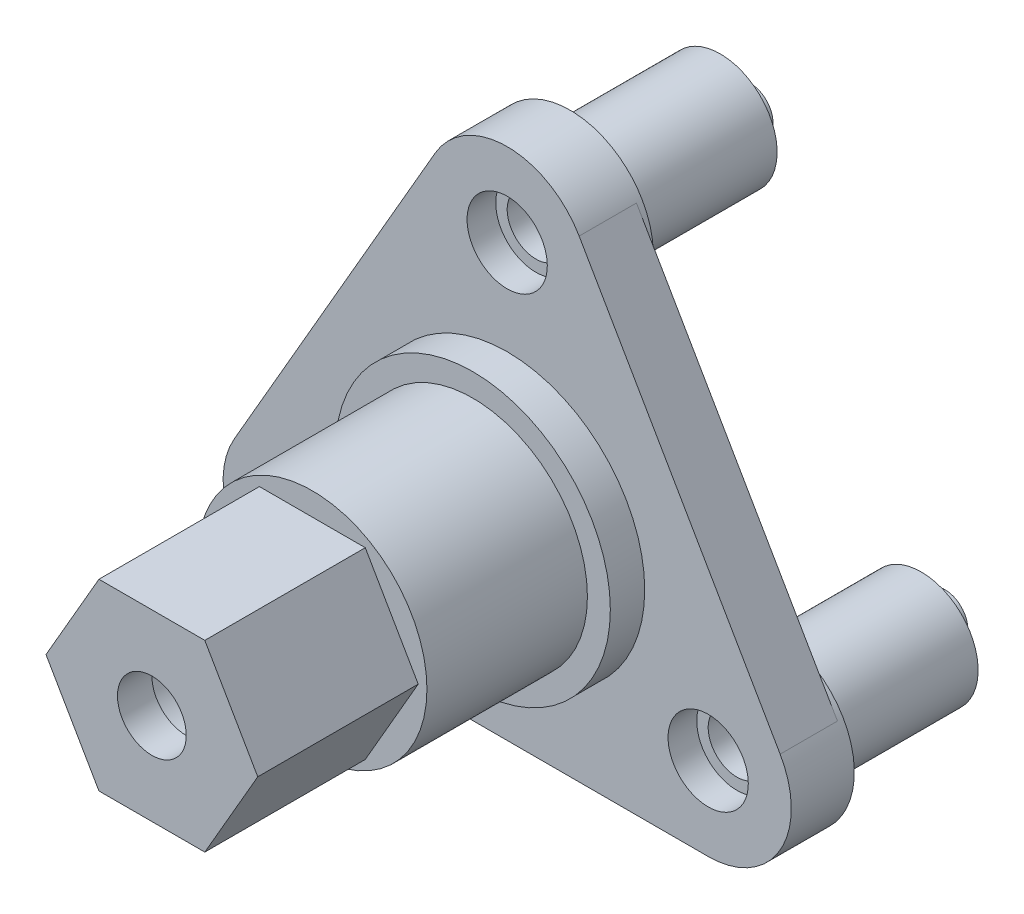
ISO-10303-21;
HEADER;
FILE_DESCRIPTION(('STEP AP214'),'2;1');
FILE_NAME('part.step','',(''),(''),'','','');
FILE_SCHEMA(('AUTOMOTIVE_DESIGN { 1 0 10303 214 1 1 1 1 }'));
ENDSEC;
DATA;
#1=APPLICATION_CONTEXT('core data for automotive mechanical design processes');
#2=APPLICATION_PROTOCOL_DEFINITION('international standard','automotive_design',2000,#1);
#3=PRODUCT_CONTEXT('',#1,'mechanical');
#4=PRODUCT('Part','Part','',(#3));
#5=PRODUCT_RELATED_PRODUCT_CATEGORY('part','',(#4));
#6=PRODUCT_DEFINITION_FORMATION('','',#4);
#7=PRODUCT_DEFINITION_CONTEXT('part definition',#1,'design');
#8=PRODUCT_DEFINITION('design','',#6,#7);
#9=PRODUCT_DEFINITION_SHAPE('','',#8);
#10=(LENGTH_UNIT() NAMED_UNIT(*) SI_UNIT(.MILLI.,.METRE.));
#11=(NAMED_UNIT(*) PLANE_ANGLE_UNIT() SI_UNIT($,.RADIAN.));
#12=(NAMED_UNIT(*) SI_UNIT($,.STERADIAN.) SOLID_ANGLE_UNIT());
#13=UNCERTAINTY_MEASURE_WITH_UNIT(LENGTH_MEASURE(1.E-05),#10,'distance_accuracy_value','');
#14=(GEOMETRIC_REPRESENTATION_CONTEXT(3) GLOBAL_UNCERTAINTY_ASSIGNED_CONTEXT((#13)) GLOBAL_UNIT_ASSIGNED_CONTEXT((#10,
#11,#12)) REPRESENTATION_CONTEXT('',''));
#15=CARTESIAN_POINT('',(0.,0.,0.));
#16=DIRECTION('',(0.,0.,1.));
#17=DIRECTION('',(1.,0.,0.));
#18=AXIS2_PLACEMENT_3D('',#15,#16,#17);
#19=CARTESIAN_POINT('',(0.,20.25,-18.6));
#20=DIRECTION('',(0.,0.,-1.));
#21=DIRECTION('',(0.499999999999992,0.866025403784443,0.));
#22=AXIS2_PLACEMENT_3D('',#19,#20,#21);
#23=PLANE('',#22);
#24=CARTESIAN_POINT('',(0.,20.25,-18.6));
#25=DIRECTION('',(0.,0.,-1.));
#26=DIRECTION('',(0.499999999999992,0.866025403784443,0.));
#27=AXIS2_PLACEMENT_3D('',#24,#25,#26);
#28=CIRCLE('',#27,4.95);
#29=CARTESIAN_POINT('',(2.47499999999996,24.536825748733,-18.6));
#30=VERTEX_POINT('',#29);
#31=EDGE_CURVE('E172',#30,#30,#28,.T.);
#32=ORIENTED_EDGE('',*,*,#31,.T.);
#33=EDGE_LOOP('',(#32));
#34=FACE_BOUND('',#33,.T.);
#35=CARTESIAN_POINT('',(0.0947521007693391,19.7934044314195,-18.6));
#36=DIRECTION('',(0.,0.,-1.));
#37=DIRECTION('',(0.499999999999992,0.866025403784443,0.));
#38=AXIS2_PLACEMENT_3D('',#35,#36,#37);
#39=CIRCLE('',#38,2.);
#40=CARTESIAN_POINT('',(1.09475210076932,21.5254552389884,-18.6));
#41=VERTEX_POINT('',#40);
#42=EDGE_CURVE('E329',#41,#41,#39,.T.);
#43=ORIENTED_EDGE('',*,*,#42,.F.);
#44=EDGE_LOOP('',(#43));
#45=FACE_BOUND('',#44,.T.);
#46=ADVANCED_FACE('F34',(#34,#45),#23,.T.);
#47=CARTESIAN_POINT('',(17.5370144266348,-10.1250000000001,-18.6));
#48=DIRECTION('',(0.,0.,-1.));
#49=DIRECTION('',(0.500000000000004,-0.866025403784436,0.));
#50=AXIS2_PLACEMENT_3D('',#47,#48,#49);
#51=PLANE('',#50);
#52=CARTESIAN_POINT('',(17.5370144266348,-10.1250000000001,-18.6));
#53=DIRECTION('',(0.,0.,-1.));
#54=DIRECTION('',(0.500000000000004,-0.866025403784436,0.));
#55=AXIS2_PLACEMENT_3D('',#52,#53,#54);
#56=CIRCLE('',#55,4.95);
#57=CARTESIAN_POINT('',(20.0120144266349,-14.411825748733,-18.6));
#58=VERTEX_POINT('',#57);
#59=EDGE_CURVE('E175',#58,#58,#56,.T.);
#60=ORIENTED_EDGE('',*,*,#59,.T.);
#61=EDGE_LOOP('',(#60));
#62=FACE_BOUND('',#61,.T.);
#63=CARTESIAN_POINT('',(17.0942150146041,-9.97875994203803,-18.6));
#64=DIRECTION('',(0.,0.,-1.));
#65=DIRECTION('',(0.500000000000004,-0.866025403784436,0.));
#66=AXIS2_PLACEMENT_3D('',#63,#64,#65);
#67=CIRCLE('',#66,2.);
#68=CARTESIAN_POINT('',(18.0942150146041,-11.7108107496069,-18.6));
#69=VERTEX_POINT('',#68);
#70=EDGE_CURVE('E162',#69,#69,#67,.T.);
#71=ORIENTED_EDGE('',*,*,#70,.F.);
#72=EDGE_LOOP('',(#71));
#73=FACE_BOUND('',#72,.T.);
#74=ADVANCED_FACE('F339',(#62,#73),#51,.T.);
#75=CARTESIAN_POINT('',(0.,20.25,-5.));
#76=DIRECTION('',(0.,0.,1.));
#77=DIRECTION('',(1.,0.,0.));
#78=AXIS2_PLACEMENT_3D('',#75,#76,#77);
#79=PLANE('',#78);
#80=CARTESIAN_POINT('',(0.,0.,-5.));
#81=DIRECTION('',(0.,0.,-1.));
#82=DIRECTION('',(-1.,0.,0.));
#83=AXIS2_PLACEMENT_3D('',#80,#81,#82);
#84=CIRCLE('',#83,10.5);
#85=CARTESIAN_POINT('',(-10.5,0.,-5.));
#86=VERTEX_POINT('',#85);
#87=EDGE_CURVE('E204',#86,#86,#84,.T.);
#88=ORIENTED_EDGE('',*,*,#87,.F.);
#89=EDGE_LOOP('',(#88));
#90=FACE_BOUND('',#89,.T.);
#91=CARTESIAN_POINT('',(0.,20.25,-5.));
#92=DIRECTION('',(0.,0.,-1.));
#93=DIRECTION('',(0.499999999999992,0.866025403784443,0.));
#94=AXIS2_PLACEMENT_3D('',#91,#92,#93);
#95=CIRCLE('',#94,7.25);
#96=CARTESIAN_POINT('',(6.27868417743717,23.875,-5.));
#97=VERTEX_POINT('',#96);
#98=CARTESIAN_POINT('',(-6.27868417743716,23.875,-5.));
#99=VERTEX_POINT('',#98);
#100=EDGE_CURVE('E134',#97,#99,#95,.T.);
#101=ORIENTED_EDGE('',*,*,#100,.F.);
#102=DIRECTION('',(0.500000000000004,-0.866025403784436,0.));
#103=VECTOR('',#102,1.);
#104=CARTESIAN_POINT('',(6.27868417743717,23.875,-5.));
#105=LINE('',#104,#103);
#106=CARTESIAN_POINT('',(23.8156986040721,-6.49999999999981,-5.));
#107=VERTEX_POINT('',#106);
#108=EDGE_CURVE('E142',#97,#107,#105,.T.);
#109=ORIENTED_EDGE('',*,*,#108,.T.);
#110=CARTESIAN_POINT('',(17.5370144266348,-10.1250000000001,-5.));
#111=DIRECTION('',(0.,0.,-1.));
#112=DIRECTION('',(0.500000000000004,-0.866025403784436,0.));
#113=AXIS2_PLACEMENT_3D('',#110,#111,#112);
#114=CIRCLE('',#113,7.25);
#115=CARTESIAN_POINT('',(17.5370144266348,-17.3749999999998,-5.));
#116=VERTEX_POINT('',#115);
#117=EDGE_CURVE('E166',#116,#107,#114,.T.);
#118=ORIENTED_EDGE('',*,*,#117,.F.);
#119=DIRECTION('',(-1.,0.,0.));
#120=VECTOR('',#119,1.);
#121=CARTESIAN_POINT('',(17.537014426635,-17.3749999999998,-5.));
#122=LINE('',#121,#120);
#123=CARTESIAN_POINT('',(-17.537014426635,-17.3749999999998,-5.));
#124=VERTEX_POINT('',#123);
#125=EDGE_CURVE('E148',#116,#124,#122,.T.);
#126=ORIENTED_EDGE('',*,*,#125,.T.);
#127=CARTESIAN_POINT('',(-17.537014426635,-10.1249999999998,-5.));
#128=DIRECTION('',(0.,0.,-1.));
#129=DIRECTION('',(-1.,0.,0.));
#130=AXIS2_PLACEMENT_3D('',#127,#128,#129);
#131=CIRCLE('',#130,7.25);
#132=CARTESIAN_POINT('',(-23.8156986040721,-6.49999999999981,-5.));
#133=VERTEX_POINT('',#132);
#134=EDGE_CURVE('E194',#133,#124,#131,.T.);
#135=ORIENTED_EDGE('',*,*,#134,.F.);
#136=DIRECTION('',(0.500000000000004,0.866025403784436,0.));
#137=VECTOR('',#136,1.);
#138=CARTESIAN_POINT('',(-23.8156986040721,-6.49999999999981,-5.));
#139=LINE('',#138,#137);
#140=EDGE_CURVE('E153',#133,#99,#139,.T.);
#141=ORIENTED_EDGE('',*,*,#140,.T.);
#142=EDGE_LOOP('',(#101,#109,#118,#126,#135,#141));
#143=FACE_BOUND('',#142,.T.);
#144=ADVANCED_FACE('F151',(#90,#143),#79,.F.);
#145=CARTESIAN_POINT('',(-17.537014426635,-10.1249999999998,-18.6));
#146=DIRECTION('',(0.,0.,-1.));
#147=DIRECTION('',(-1.,0.,0.));
#148=AXIS2_PLACEMENT_3D('',#145,#146,#147);
#149=PLANE('',#148);
#150=CARTESIAN_POINT('',(-17.537014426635,-10.1249999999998,-18.6));
#151=DIRECTION('',(0.,0.,-1.));
#152=DIRECTION('',(-1.,0.,0.));
#153=AXIS2_PLACEMENT_3D('',#150,#151,#152);
#154=CIRCLE('',#153,4.95);
#155=CARTESIAN_POINT('',(-22.487014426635,-10.1249999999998,-18.6));
#156=VERTEX_POINT('',#155);
#157=EDGE_CURVE('E201',#156,#156,#154,.T.);
#158=ORIENTED_EDGE('',*,*,#157,.T.);
#159=EDGE_LOOP('',(#158));
#160=FACE_BOUND('',#159,.T.);
#161=CARTESIAN_POINT('',(-17.1889671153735,-9.81464448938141,-18.6));
#162=DIRECTION('',(0.,0.,-1.));
#163=DIRECTION('',(-1.,0.,0.));
#164=AXIS2_PLACEMENT_3D('',#161,#162,#163);
#165=CIRCLE('',#164,2.);
#166=CARTESIAN_POINT('',(-19.1889671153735,-9.81464448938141,-18.6));
#167=VERTEX_POINT('',#166);
#168=EDGE_CURVE('E188',#167,#167,#165,.T.);
#169=ORIENTED_EDGE('',*,*,#168,.F.);
#170=EDGE_LOOP('',(#169));
#171=FACE_BOUND('',#170,.T.);
#172=ADVANCED_FACE('F347',(#160,#171),#149,.T.);
#173=CARTESIAN_POINT('',(0.,0.,28.));
#174=DIRECTION('',(0.,0.,-1.));
#175=DIRECTION('',(-1.,0.,0.));
#176=AXIS2_PLACEMENT_3D('',#173,#174,#175);
#177=CYLINDRICAL_SURFACE('',#176,4.05);
#178=CARTESIAN_POINT('',(0.,0.,28.));
#179=DIRECTION('',(0.,0.,-1.));
#180=DIRECTION('',(-1.,0.,0.));
#181=AXIS2_PLACEMENT_3D('',#178,#179,#180);
#182=CIRCLE('',#181,4.05);
#183=CARTESIAN_POINT('',(-4.05,0.,28.));
#184=VERTEX_POINT('',#183);
#185=EDGE_CURVE('E237',#184,#184,#182,.T.);
#186=ORIENTED_EDGE('',*,*,#185,.F.);
#187=EDGE_LOOP('',(#186));
#188=FACE_BOUND('',#187,.T.);
#189=CARTESIAN_POINT('',(0.,0.,-4.));
#190=DIRECTION('',(0.,0.,-1.));
#191=DIRECTION('',(-1.,0.,0.));
#192=AXIS2_PLACEMENT_3D('',#189,#190,#191);
#193=CIRCLE('',#192,4.05);
#194=CARTESIAN_POINT('',(-4.05,0.,-4.));
#195=VERTEX_POINT('',#194);
#196=EDGE_CURVE('E210',#195,#195,#193,.F.);
#197=ORIENTED_EDGE('',*,*,#196,.F.);
#198=EDGE_LOOP('',(#197));
#199=FACE_BOUND('',#198,.T.);
#200=ADVANCED_FACE('F393',(#188,#199),#177,.F.);
#201=CARTESIAN_POINT('',(0.,0.,31.));
#202=DIRECTION('',(0.,0.,-1.));
#203=DIRECTION('',(-1.,0.,0.));
#204=AXIS2_PLACEMENT_3D('',#201,#202,#203);
#205=CYLINDRICAL_SURFACE('',#204,3.);
#206=CARTESIAN_POINT('',(0.,0.,31.));
#207=DIRECTION('',(0.,0.,1.));
#208=DIRECTION('',(1.,0.,0.));
#209=AXIS2_PLACEMENT_3D('',#206,#207,#208);
#210=CIRCLE('',#209,3.);
#211=CARTESIAN_POINT('',(3.,0.,31.));
#212=VERTEX_POINT('',#211);
#213=EDGE_CURVE('E11',#212,#212,#210,.T.);
#214=ORIENTED_EDGE('',*,*,#213,.T.);
#215=EDGE_LOOP('',(#214));
#216=FACE_BOUND('',#215,.T.);
#217=CARTESIAN_POINT('',(0.,0.,28.));
#218=DIRECTION('',(0.,0.,-1.));
#219=DIRECTION('',(-1.,0.,0.));
#220=AXIS2_PLACEMENT_3D('',#217,#218,#219);
#221=CIRCLE('',#220,3.);
#222=CARTESIAN_POINT('',(-3.,0.,28.));
#223=VERTEX_POINT('',#222);
#224=EDGE_CURVE('E240',#223,#223,#221,.T.);
#225=ORIENTED_EDGE('',*,*,#224,.T.);
#226=EDGE_LOOP('',(#225));
#227=FACE_BOUND('',#226,.T.);
#228=ADVANCED_FACE('F436',(#216,#227),#205,.F.);
#229=CARTESIAN_POINT('',(0.,0.,31.));
#230=DIRECTION('',(0.,0.,1.));
#231=DIRECTION('',(1.,0.,0.));
#232=AXIS2_PLACEMENT_3D('',#229,#230,#231);
#233=PLANE('',#232);
#234=ORIENTED_EDGE('',*,*,#213,.F.);
#235=EDGE_LOOP('',(#234));
#236=FACE_BOUND('',#235,.T.);
#237=DIRECTION('',(1.,0.,0.));
#238=VECTOR('',#237,1.);
#239=CARTESIAN_POINT('',(-4.61880215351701,-8.,31.));
#240=LINE('',#239,#238);
#241=CARTESIAN_POINT('',(-4.61880215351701,-8.,31.));
#242=VERTEX_POINT('',#241);
#243=CARTESIAN_POINT('',(4.61880215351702,-8.,31.));
#244=VERTEX_POINT('',#243);
#245=EDGE_CURVE('E254',#242,#244,#240,.T.);
#246=ORIENTED_EDGE('',*,*,#245,.T.);
#247=DIRECTION('',(0.499999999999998,0.86602540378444,0.));
#248=VECTOR('',#247,1.);
#249=CARTESIAN_POINT('',(4.61880215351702,-8.,31.));
#250=LINE('',#249,#248);
#251=CARTESIAN_POINT('',(9.23760430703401,0.,31.));
#252=VERTEX_POINT('',#251);
#253=EDGE_CURVE('E241',#244,#252,#250,.T.);
#254=ORIENTED_EDGE('',*,*,#253,.T.);
#255=DIRECTION('',(-0.5,0.866025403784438,0.));
#256=VECTOR('',#255,1.);
#257=CARTESIAN_POINT('',(9.23760430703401,0.,31.));
#258=LINE('',#257,#256);
#259=CARTESIAN_POINT('',(4.61880215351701,7.99999999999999,31.));
#260=VERTEX_POINT('',#259);
#261=EDGE_CURVE('E244',#252,#260,#258,.T.);
#262=ORIENTED_EDGE('',*,*,#261,.T.);
#263=DIRECTION('',(-1.,0.,0.));
#264=VECTOR('',#263,1.);
#265=CARTESIAN_POINT('',(4.61880215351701,7.99999999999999,31.));
#266=LINE('',#265,#264);
#267=CARTESIAN_POINT('',(-4.618802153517,7.99999999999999,31.));
#268=VERTEX_POINT('',#267);
#269=EDGE_CURVE('E51',#260,#268,#266,.T.);
#270=ORIENTED_EDGE('',*,*,#269,.T.);
#271=DIRECTION('',(-0.500000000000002,-0.866025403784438,0.));
#272=VECTOR('',#271,1.);
#273=CARTESIAN_POINT('',(-4.618802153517,7.99999999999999,31.));
#274=LINE('',#273,#272);
#275=CARTESIAN_POINT('',(-9.23760430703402,0.,31.));
#276=VERTEX_POINT('',#275);
#277=EDGE_CURVE('E248',#268,#276,#274,.T.);
#278=ORIENTED_EDGE('',*,*,#277,.T.);
#279=DIRECTION('',(0.5,-0.866025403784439,0.));
#280=VECTOR('',#279,1.);
#281=CARTESIAN_POINT('',(-9.23760430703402,0.,31.));
#282=LINE('',#281,#280);
#283=EDGE_CURVE('E251',#276,#242,#282,.T.);
#284=ORIENTED_EDGE('',*,*,#283,.T.);
#285=EDGE_LOOP('',(#246,#254,#262,#270,#278,#284));
#286=FACE_BOUND('',#285,.T.);
#287=ADVANCED_FACE('F468',(#236,#286),#233,.T.);
#288=CARTESIAN_POINT('',(0.,0.,3.));
#289=DIRECTION('',(0.,0.,1.));
#290=DIRECTION('',(1.,0.,0.));
#291=AXIS2_PLACEMENT_3D('',#288,#289,#290);
#292=CYLINDRICAL_SURFACE('',#291,10.);
#293=CARTESIAN_POINT('',(0.,0.,3.));
#294=DIRECTION('',(0.,0.,1.));
#295=DIRECTION('',(1.,0.,0.));
#296=AXIS2_PLACEMENT_3D('',#293,#294,#295);
#297=CIRCLE('',#296,10.);
#298=CARTESIAN_POINT('',(10.,0.,3.));
#299=VERTEX_POINT('',#298);
#300=EDGE_CURVE('E286',#299,#299,#297,.T.);
#301=ORIENTED_EDGE('',*,*,#300,.T.);
#302=EDGE_LOOP('',(#301));
#303=FACE_BOUND('',#302,.T.);
#304=CARTESIAN_POINT('',(0.,0.,17.));
#305=DIRECTION('',(0.,0.,1.));
#306=DIRECTION('',(1.,0.,0.));
#307=AXIS2_PLACEMENT_3D('',#304,#305,#306);
#308=CIRCLE('',#307,10.);
#309=CARTESIAN_POINT('',(10.,0.,17.));
#310=VERTEX_POINT('',#309);
#311=EDGE_CURVE('E276',#310,#310,#308,.F.);
#312=ORIENTED_EDGE('',*,*,#311,.T.);
#313=EDGE_LOOP('',(#312));
#314=FACE_BOUND('',#313,.T.);
#315=ADVANCED_FACE('F465',(#303,#314),#292,.T.);
#316=CARTESIAN_POINT('',(0.,0.,31.));
#317=DIRECTION('',(0.,0.,-1.));
#318=DIRECTION('',(-1.,0.,0.));
#319=AXIS2_PLACEMENT_3D('',#316,#317,#318);
#320=CYLINDRICAL_SURFACE('',#319,12.);
#321=CARTESIAN_POINT('',(0.,0.,0.));
#322=DIRECTION('',(0.,0.,1.));
#323=DIRECTION('',(1.,0.,0.));
#324=AXIS2_PLACEMENT_3D('',#321,#322,#323);
#325=CIRCLE('',#324,12.);
#326=CARTESIAN_POINT('',(12.,0.,0.));
#327=VERTEX_POINT('',#326);
#328=EDGE_CURVE('E138',#327,#327,#325,.T.);
#329=ORIENTED_EDGE('',*,*,#328,.T.);
#330=EDGE_LOOP('',(#329));
#331=FACE_BOUND('',#330,.T.);
#332=CARTESIAN_POINT('',(0.,0.,3.));
#333=DIRECTION('',(0.,0.,1.));
#334=DIRECTION('',(1.,0.,0.));
#335=AXIS2_PLACEMENT_3D('',#332,#333,#334);
#336=CIRCLE('',#335,12.);
#337=CARTESIAN_POINT('',(12.,0.,3.));
#338=VERTEX_POINT('',#337);
#339=EDGE_CURVE('E43',#338,#338,#336,.T.);
#340=ORIENTED_EDGE('',*,*,#339,.F.);
#341=EDGE_LOOP('',(#340));
#342=FACE_BOUND('',#341,.T.);
#343=ADVANCED_FACE('F36',(#331,#342),#320,.T.);
#344=CARTESIAN_POINT('',(0.,0.,3.));
#345=DIRECTION('',(0.,0.,1.));
#346=DIRECTION('',(1.,0.,0.));
#347=AXIS2_PLACEMENT_3D('',#344,#345,#346);
#348=PLANE('',#347);
#349=ORIENTED_EDGE('',*,*,#300,.F.);
#350=EDGE_LOOP('',(#349));
#351=FACE_BOUND('',#350,.T.);
#352=ORIENTED_EDGE('',*,*,#339,.T.);
#353=EDGE_LOOP('',(#352));
#354=FACE_BOUND('',#353,.T.);
#355=ADVANCED_FACE('F463',(#351,#354),#348,.T.);
#356=CARTESIAN_POINT('',(0.,0.,17.));
#357=DIRECTION('',(0.,0.,1.));
#358=DIRECTION('',(1.,0.,0.));
#359=AXIS2_PLACEMENT_3D('',#356,#357,#358);
#360=PLANE('',#359);
#361=ORIENTED_EDGE('',*,*,#311,.F.);
#362=EDGE_LOOP('',(#361));
#363=FACE_BOUND('',#362,.T.);
#364=DIRECTION('',(1.,0.,0.));
#365=VECTOR('',#364,1.);
#366=CARTESIAN_POINT('',(-4.61880215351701,-8.,17.));
#367=LINE('',#366,#365);
#368=CARTESIAN_POINT('',(-4.61880215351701,-8.,17.));
#369=VERTEX_POINT('',#368);
#370=CARTESIAN_POINT('',(4.61880215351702,-8.,17.));
#371=VERTEX_POINT('',#370);
#372=EDGE_CURVE('E270',#369,#371,#367,.T.);
#373=ORIENTED_EDGE('',*,*,#372,.F.);
#374=DIRECTION('',(0.5,-0.866025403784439,0.));
#375=VECTOR('',#374,1.);
#376=CARTESIAN_POINT('',(-9.23760430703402,0.,17.));
#377=LINE('',#376,#375);
#378=CARTESIAN_POINT('',(-9.23760430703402,0.,17.));
#379=VERTEX_POINT('',#378);
#380=EDGE_CURVE('E267',#379,#369,#377,.T.);
#381=ORIENTED_EDGE('',*,*,#380,.F.);
#382=DIRECTION('',(-0.500000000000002,-0.866025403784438,0.));
#383=VECTOR('',#382,1.);
#384=CARTESIAN_POINT('',(-4.618802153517,7.99999999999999,17.));
#385=LINE('',#384,#383);
#386=CARTESIAN_POINT('',(-4.618802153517,7.99999999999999,17.));
#387=VERTEX_POINT('',#386);
#388=EDGE_CURVE('E264',#387,#379,#385,.T.);
#389=ORIENTED_EDGE('',*,*,#388,.F.);
#390=DIRECTION('',(-1.,0.,0.));
#391=VECTOR('',#390,1.);
#392=CARTESIAN_POINT('',(4.61880215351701,7.99999999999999,17.));
#393=LINE('',#392,#391);
#394=CARTESIAN_POINT('',(4.61880215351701,7.99999999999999,17.));
#395=VERTEX_POINT('',#394);
#396=EDGE_CURVE('E59',#395,#387,#393,.T.);
#397=ORIENTED_EDGE('',*,*,#396,.F.);
#398=DIRECTION('',(-0.5,0.866025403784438,0.));
#399=VECTOR('',#398,1.);
#400=CARTESIAN_POINT('',(9.23760430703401,0.,17.));
#401=LINE('',#400,#399);
#402=CARTESIAN_POINT('',(9.23760430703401,0.,17.));
#403=VERTEX_POINT('',#402);
#404=EDGE_CURVE('E260',#403,#395,#401,.T.);
#405=ORIENTED_EDGE('',*,*,#404,.F.);
#406=DIRECTION('',(0.499999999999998,0.86602540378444,0.));
#407=VECTOR('',#406,1.);
#408=CARTESIAN_POINT('',(4.61880215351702,-8.,17.));
#409=LINE('',#408,#407);
#410=EDGE_CURVE('E257',#371,#403,#409,.T.);
#411=ORIENTED_EDGE('',*,*,#410,.F.);
#412=EDGE_LOOP('',(#373,#381,#389,#397,#405,#411));
#413=FACE_BOUND('',#412,.T.);
#414=ADVANCED_FACE('F459',(#363,#413),#360,.T.);
#415=CARTESIAN_POINT('',(4.61880215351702,-8.,17.));
#416=DIRECTION('',(0.86602540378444,-0.499999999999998,0.));
#417=DIRECTION('',(0.499999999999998,0.86602540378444,0.));
#418=AXIS2_PLACEMENT_3D('',#415,#416,#417);
#419=PLANE('',#418);
#420=ORIENTED_EDGE('',*,*,#253,.F.);
#421=DIRECTION('',(0.,0.,1.));
#422=VECTOR('',#421,1.);
#423=CARTESIAN_POINT('',(4.61880215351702,-8.,17.));
#424=LINE('',#423,#422);
#425=EDGE_CURVE('E274',#371,#244,#424,.T.);
#426=ORIENTED_EDGE('',*,*,#425,.F.);
#427=ORIENTED_EDGE('',*,*,#410,.T.);
#428=DIRECTION('',(0.,0.,1.));
#429=VECTOR('',#428,1.);
#430=CARTESIAN_POINT('',(9.23760430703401,0.,17.));
#431=LINE('',#430,#429);
#432=EDGE_CURVE('E273',#403,#252,#431,.T.);
#433=ORIENTED_EDGE('',*,*,#432,.T.);
#434=EDGE_LOOP('',(#420,#426,#427,#433));
#435=FACE_BOUND('',#434,.T.);
#436=ADVANCED_FACE('F442',(#435),#419,.T.);
#437=CARTESIAN_POINT('',(-4.61880215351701,-8.,17.));
#438=DIRECTION('',(0.,-1.,0.));
#439=DIRECTION('',(0.,0.,-1.));
#440=AXIS2_PLACEMENT_3D('',#437,#438,#439);
#441=PLANE('',#440);
#442=ORIENTED_EDGE('',*,*,#245,.F.);
#443=DIRECTION('',(0.,0.,1.));
#444=VECTOR('',#443,1.);
#445=CARTESIAN_POINT('',(-4.61880215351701,-8.,17.));
#446=LINE('',#445,#444);
#447=EDGE_CURVE('E277',#369,#242,#446,.T.);
#448=ORIENTED_EDGE('',*,*,#447,.F.);
#449=ORIENTED_EDGE('',*,*,#372,.T.);
#450=ORIENTED_EDGE('',*,*,#425,.T.);
#451=EDGE_LOOP('',(#442,#448,#449,#450));
#452=FACE_BOUND('',#451,.T.);
#453=ADVANCED_FACE('F438',(#452),#441,.T.);
#454=CARTESIAN_POINT('',(-9.23760430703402,0.,17.));
#455=DIRECTION('',(-0.866025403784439,-0.5,0.));
#456=DIRECTION('',(0.5,-0.866025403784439,0.));
#457=AXIS2_PLACEMENT_3D('',#454,#455,#456);
#458=PLANE('',#457);
#459=ORIENTED_EDGE('',*,*,#283,.F.);
#460=DIRECTION('',(0.,0.,1.));
#461=VECTOR('',#460,1.);
#462=CARTESIAN_POINT('',(-9.23760430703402,0.,17.));
#463=LINE('',#462,#461);
#464=EDGE_CURVE('E279',#379,#276,#463,.T.);
#465=ORIENTED_EDGE('',*,*,#464,.F.);
#466=ORIENTED_EDGE('',*,*,#380,.T.);
#467=ORIENTED_EDGE('',*,*,#447,.T.);
#468=EDGE_LOOP('',(#459,#465,#466,#467));
#469=FACE_BOUND('',#468,.T.);
#470=ADVANCED_FACE('F441',(#469),#458,.T.);
#471=CARTESIAN_POINT('',(-4.618802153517,7.99999999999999,17.));
#472=DIRECTION('',(-0.866025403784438,0.500000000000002,0.));
#473=DIRECTION('',(-0.500000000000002,-0.866025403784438,0.));
#474=AXIS2_PLACEMENT_3D('',#471,#472,#473);
#475=PLANE('',#474);
#476=ORIENTED_EDGE('',*,*,#277,.F.);
#477=DIRECTION('',(0.,0.,1.));
#478=VECTOR('',#477,1.);
#479=CARTESIAN_POINT('',(-4.618802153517,7.99999999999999,17.));
#480=LINE('',#479,#478);
#481=EDGE_CURVE('E281',#387,#268,#480,.T.);
#482=ORIENTED_EDGE('',*,*,#481,.F.);
#483=ORIENTED_EDGE('',*,*,#388,.T.);
#484=ORIENTED_EDGE('',*,*,#464,.T.);
#485=EDGE_LOOP('',(#476,#482,#483,#484));
#486=FACE_BOUND('',#485,.T.);
#487=ADVANCED_FACE('F446',(#486),#475,.T.);
#488=CARTESIAN_POINT('',(4.61880215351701,7.99999999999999,17.));
#489=DIRECTION('',(0.,1.,0.));
#490=DIRECTION('',(0.,0.,1.));
#491=AXIS2_PLACEMENT_3D('',#488,#489,#490);
#492=PLANE('',#491);
#493=ORIENTED_EDGE('',*,*,#269,.F.);
#494=DIRECTION('',(0.,0.,1.));
#495=VECTOR('',#494,1.);
#496=CARTESIAN_POINT('',(4.61880215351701,7.99999999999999,17.));
#497=LINE('',#496,#495);
#498=EDGE_CURVE('E283',#395,#260,#497,.T.);
#499=ORIENTED_EDGE('',*,*,#498,.F.);
#500=ORIENTED_EDGE('',*,*,#396,.T.);
#501=ORIENTED_EDGE('',*,*,#481,.T.);
#502=EDGE_LOOP('',(#493,#499,#500,#501));
#503=FACE_BOUND('',#502,.T.);
#504=ADVANCED_FACE('F450',(#503),#492,.T.);
#505=CARTESIAN_POINT('',(9.23760430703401,0.,17.));
#506=DIRECTION('',(0.866025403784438,0.5,0.));
#507=DIRECTION('',(-0.5,0.866025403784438,0.));
#508=AXIS2_PLACEMENT_3D('',#505,#506,#507);
#509=PLANE('',#508);
#510=ORIENTED_EDGE('',*,*,#261,.F.);
#511=ORIENTED_EDGE('',*,*,#432,.F.);
#512=ORIENTED_EDGE('',*,*,#404,.T.);
#513=ORIENTED_EDGE('',*,*,#498,.T.);
#514=EDGE_LOOP('',(#510,#511,#512,#513));
#515=FACE_BOUND('',#514,.T.);
#516=ADVANCED_FACE('F432',(#515),#509,.T.);
#517=CARTESIAN_POINT('',(0.,0.,28.));
#518=DIRECTION('',(0.,0.,-1.));
#519=DIRECTION('',(-1.,0.,0.));
#520=AXIS2_PLACEMENT_3D('',#517,#518,#519);
#521=PLANE('',#520);
#522=ORIENTED_EDGE('',*,*,#224,.F.);
#523=EDGE_LOOP('',(#522));
#524=FACE_BOUND('',#523,.T.);
#525=ORIENTED_EDGE('',*,*,#185,.T.);
#526=EDGE_LOOP('',(#525));
#527=FACE_BOUND('',#526,.T.);
#528=ADVANCED_FACE('F408',(#524,#527),#521,.T.);
#529=CARTESIAN_POINT('',(0.,20.25,0.));
#530=DIRECTION('',(0.,0.,1.));
#531=DIRECTION('',(1.,0.,0.));
#532=AXIS2_PLACEMENT_3D('',#529,#530,#531);
#533=PLANE('',#532);
#534=CARTESIAN_POINT('',(0.,20.25,0.));
#535=DIRECTION('',(0.,0.,1.));
#536=DIRECTION('',(-0.499999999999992,-0.866025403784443,0.));
#537=AXIS2_PLACEMENT_3D('',#534,#535,#536);
#538=CIRCLE('',#537,3.5);
#539=CARTESIAN_POINT('',(-1.74999999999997,17.2189110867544,0.));
#540=VERTEX_POINT('',#539);
#541=EDGE_CURVE('E306',#540,#540,#538,.T.);
#542=ORIENTED_EDGE('',*,*,#541,.F.);
#543=EDGE_LOOP('',(#542));
#544=FACE_BOUND('',#543,.T.);
#545=CARTESIAN_POINT('',(17.5370144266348,-10.1250000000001,0.));
#546=DIRECTION('',(0.,0.,1.));
#547=DIRECTION('',(-0.500000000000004,0.866025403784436,0.));
#548=AXIS2_PLACEMENT_3D('',#545,#546,#547);
#549=CIRCLE('',#548,3.5);
#550=CARTESIAN_POINT('',(15.7870144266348,-7.09391108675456,0.));
#551=VERTEX_POINT('',#550);
#552=EDGE_CURVE('E323',#551,#551,#549,.T.);
#553=ORIENTED_EDGE('',*,*,#552,.F.);
#554=EDGE_LOOP('',(#553));
#555=FACE_BOUND('',#554,.T.);
#556=CARTESIAN_POINT('',(-17.537014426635,-10.1249999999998,0.));
#557=DIRECTION('',(0.,0.,1.));
#558=DIRECTION('',(1.,0.,0.));
#559=AXIS2_PLACEMENT_3D('',#556,#557,#558);
#560=CIRCLE('',#559,3.5);
#561=CARTESIAN_POINT('',(-14.037014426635,-10.1249999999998,0.));
#562=VERTEX_POINT('',#561);
#563=EDGE_CURVE('E182',#562,#562,#560,.T.);
#564=ORIENTED_EDGE('',*,*,#563,.F.);
#565=EDGE_LOOP('',(#564));
#566=FACE_BOUND('',#565,.T.);
#567=CARTESIAN_POINT('',(0.,20.25,0.));
#568=DIRECTION('',(0.,0.,-1.));
#569=DIRECTION('',(1.,0.,0.));
#570=AXIS2_PLACEMENT_3D('',#567,#568,#569);
#571=CIRCLE('',#570,7.25);
#572=CARTESIAN_POINT('',(-6.27868417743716,23.875,0.));
#573=VERTEX_POINT('',#572);
#574=CARTESIAN_POINT('',(6.27868417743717,23.875,0.));
#575=VERTEX_POINT('',#574);
#576=EDGE_CURVE('E136',#573,#575,#571,.T.);
#577=ORIENTED_EDGE('',*,*,#576,.F.);
#578=DIRECTION('',(0.500000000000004,0.866025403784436,0.));
#579=VECTOR('',#578,1.);
#580=CARTESIAN_POINT('',(-23.8156986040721,-6.49999999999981,0.));
#581=LINE('',#580,#579);
#582=CARTESIAN_POINT('',(-23.8156986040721,-6.49999999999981,0.));
#583=VERTEX_POINT('',#582);
#584=EDGE_CURVE('E149',#583,#573,#581,.T.);
#585=ORIENTED_EDGE('',*,*,#584,.F.);
#586=CARTESIAN_POINT('',(-17.537014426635,-10.1249999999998,0.));
#587=DIRECTION('',(0.,0.,-1.));
#588=DIRECTION('',(-1.,0.,0.));
#589=AXIS2_PLACEMENT_3D('',#586,#587,#588);
#590=CIRCLE('',#589,7.25);
#591=CARTESIAN_POINT('',(-17.537014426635,-17.3749999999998,0.));
#592=VERTEX_POINT('',#591);
#593=EDGE_CURVE('E218',#592,#583,#590,.T.);
#594=ORIENTED_EDGE('',*,*,#593,.F.);
#595=DIRECTION('',(-1.,0.,0.));
#596=VECTOR('',#595,1.);
#597=CARTESIAN_POINT('',(17.537014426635,-17.3749999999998,0.));
#598=LINE('',#597,#596);
#599=CARTESIAN_POINT('',(17.537014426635,-17.3749999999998,0.));
#600=VERTEX_POINT('',#599);
#601=EDGE_CURVE('E216',#600,#592,#598,.T.);
#602=ORIENTED_EDGE('',*,*,#601,.F.);
#603=CARTESIAN_POINT('',(17.537014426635,-10.1249999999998,0.));
#604=DIRECTION('',(0.,0.,-1.));
#605=DIRECTION('',(1.,0.,0.));
#606=AXIS2_PLACEMENT_3D('',#603,#604,#605);
#607=CIRCLE('',#606,7.25);
#608=CARTESIAN_POINT('',(23.8156986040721,-6.49999999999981,0.));
#609=VERTEX_POINT('',#608);
#610=EDGE_CURVE('E214',#609,#600,#607,.T.);
#611=ORIENTED_EDGE('',*,*,#610,.F.);
#612=DIRECTION('',(0.500000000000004,-0.866025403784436,0.));
#613=VECTOR('',#612,1.);
#614=CARTESIAN_POINT('',(6.27868417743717,23.875,0.));
#615=LINE('',#614,#613);
#616=EDGE_CURVE('E212',#575,#609,#615,.T.);
#617=ORIENTED_EDGE('',*,*,#616,.F.);
#618=EDGE_LOOP('',(#577,#585,#594,#602,#611,#617));
#619=FACE_BOUND('',#618,.T.);
#620=ORIENTED_EDGE('',*,*,#328,.F.);
#621=EDGE_LOOP('',(#620));
#622=FACE_BOUND('',#621,.T.);
#623=ADVANCED_FACE('F406',(#544,#555,#566,#619,#622),#533,.T.);
#624=CARTESIAN_POINT('',(0.,20.25,-5.));
#625=DIRECTION('',(0.,0.,1.));
#626=DIRECTION('',(1.,0.,0.));
#627=AXIS2_PLACEMENT_3D('',#624,#625,#626);
#628=CYLINDRICAL_SURFACE('',#627,7.25);
#629=ORIENTED_EDGE('',*,*,#576,.T.);
#630=DIRECTION('',(0.,0.,1.));
#631=VECTOR('',#630,1.);
#632=CARTESIAN_POINT('',(6.27868417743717,23.875,-5.));
#633=LINE('',#632,#631);
#634=EDGE_CURVE('E128',#97,#575,#633,.T.);
#635=ORIENTED_EDGE('',*,*,#634,.F.);
#636=ORIENTED_EDGE('',*,*,#100,.T.);
#637=DIRECTION('',(0.,0.,1.));
#638=VECTOR('',#637,1.);
#639=CARTESIAN_POINT('',(-6.27868417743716,23.875,-5.));
#640=LINE('',#639,#638);
#641=EDGE_CURVE('E223',#99,#573,#640,.T.);
#642=ORIENTED_EDGE('',*,*,#641,.T.);
#643=EDGE_LOOP('',(#629,#635,#636,#642));
#644=FACE_BOUND('',#643,.T.);
#645=CARTESIAN_POINT('',(0.,20.25,-5.5));
#646=DIRECTION('',(0.,0.,-1.));
#647=DIRECTION('',(0.499999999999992,0.866025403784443,0.));
#648=AXIS2_PLACEMENT_3D('',#645,#646,#647);
#649=CIRCLE('',#648,7.25);
#650=CARTESIAN_POINT('',(3.62499999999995,26.5286841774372,-5.5));
#651=VERTEX_POINT('',#650);
#652=EDGE_CURVE('E155',#651,#651,#649,.T.);
#653=ORIENTED_EDGE('',*,*,#652,.F.);
#654=EDGE_LOOP('',(#653));
#655=FACE_BOUND('',#654,.T.);
#656=ADVANCED_FACE('F130',(#644,#655),#628,.T.);
#657=CARTESIAN_POINT('',(6.27868417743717,23.875,-5.));
#658=DIRECTION('',(-0.866025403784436,-0.500000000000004,0.));
#659=DIRECTION('',(0.500000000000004,-0.866025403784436,0.));
#660=AXIS2_PLACEMENT_3D('',#657,#658,#659);
#661=PLANE('',#660);
#662=ORIENTED_EDGE('',*,*,#616,.T.);
#663=DIRECTION('',(0.,0.,1.));
#664=VECTOR('',#663,1.);
#665=CARTESIAN_POINT('',(23.8156986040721,-6.49999999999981,-5.));
#666=LINE('',#665,#664);
#667=EDGE_CURVE('E139',#107,#609,#666,.T.);
#668=ORIENTED_EDGE('',*,*,#667,.F.);
#669=ORIENTED_EDGE('',*,*,#108,.F.);
#670=ORIENTED_EDGE('',*,*,#634,.T.);
#671=EDGE_LOOP('',(#662,#668,#669,#670));
#672=FACE_BOUND('',#671,.T.);
#673=ADVANCED_FACE('F143',(#672),#661,.F.);
#674=CARTESIAN_POINT('',(17.537014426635,-10.1249999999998,-5.));
#675=DIRECTION('',(0.,0.,1.));
#676=DIRECTION('',(1.,0.,0.));
#677=AXIS2_PLACEMENT_3D('',#674,#675,#676);
#678=CYLINDRICAL_SURFACE('',#677,7.25);
#679=ORIENTED_EDGE('',*,*,#610,.T.);
#680=DIRECTION('',(0.,0.,1.));
#681=VECTOR('',#680,1.);
#682=CARTESIAN_POINT('',(17.537014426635,-17.3749999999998,-5.));
#683=LINE('',#682,#681);
#684=EDGE_CURVE('E231',#116,#600,#683,.T.);
#685=ORIENTED_EDGE('',*,*,#684,.F.);
#686=ORIENTED_EDGE('',*,*,#117,.T.);
#687=ORIENTED_EDGE('',*,*,#667,.T.);
#688=EDGE_LOOP('',(#679,#685,#686,#687));
#689=FACE_BOUND('',#688,.T.);
#690=CARTESIAN_POINT('',(17.5370144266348,-10.1250000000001,-5.5));
#691=DIRECTION('',(0.,0.,-1.));
#692=DIRECTION('',(0.500000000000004,-0.866025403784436,0.));
#693=AXIS2_PLACEMENT_3D('',#690,#691,#692);
#694=CIRCLE('',#693,7.25);
#695=CARTESIAN_POINT('',(21.1620144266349,-16.4036841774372,-5.5));
#696=VERTEX_POINT('',#695);
#697=EDGE_CURVE('E168',#696,#696,#694,.T.);
#698=ORIENTED_EDGE('',*,*,#697,.F.);
#699=EDGE_LOOP('',(#698));
#700=FACE_BOUND('',#699,.T.);
#701=ADVANCED_FACE('F421',(#689,#700),#678,.T.);
#702=CARTESIAN_POINT('',(17.537014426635,-17.3749999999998,-5.));
#703=DIRECTION('',(0.,1.,0.));
#704=DIRECTION('',(-1.,0.,0.));
#705=AXIS2_PLACEMENT_3D('',#702,#703,#704);
#706=PLANE('',#705);
#707=ORIENTED_EDGE('',*,*,#601,.T.);
#708=DIRECTION('',(0.,0.,1.));
#709=VECTOR('',#708,1.);
#710=CARTESIAN_POINT('',(-17.537014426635,-17.3749999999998,-5.));
#711=LINE('',#710,#709);
#712=EDGE_CURVE('E228',#124,#592,#711,.T.);
#713=ORIENTED_EDGE('',*,*,#712,.F.);
#714=ORIENTED_EDGE('',*,*,#125,.F.);
#715=ORIENTED_EDGE('',*,*,#684,.T.);
#716=EDGE_LOOP('',(#707,#713,#714,#715));
#717=FACE_BOUND('',#716,.T.);
#718=ADVANCED_FACE('F417',(#717),#706,.F.);
#719=CARTESIAN_POINT('',(-17.537014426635,-10.1249999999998,-5.));
#720=DIRECTION('',(0.,0.,1.));
#721=DIRECTION('',(1.,0.,0.));
#722=AXIS2_PLACEMENT_3D('',#719,#720,#721);
#723=CYLINDRICAL_SURFACE('',#722,7.25);
#724=ORIENTED_EDGE('',*,*,#593,.T.);
#725=DIRECTION('',(0.,0.,1.));
#726=VECTOR('',#725,1.);
#727=CARTESIAN_POINT('',(-23.8156986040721,-6.49999999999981,-5.));
#728=LINE('',#727,#726);
#729=EDGE_CURVE('E225',#133,#583,#728,.T.);
#730=ORIENTED_EDGE('',*,*,#729,.F.);
#731=ORIENTED_EDGE('',*,*,#134,.T.);
#732=ORIENTED_EDGE('',*,*,#712,.T.);
#733=EDGE_LOOP('',(#724,#730,#731,#732));
#734=FACE_BOUND('',#733,.T.);
#735=CARTESIAN_POINT('',(-17.537014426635,-10.1249999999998,-5.5));
#736=DIRECTION('',(0.,0.,-1.));
#737=DIRECTION('',(-1.,0.,0.));
#738=AXIS2_PLACEMENT_3D('',#735,#736,#737);
#739=CIRCLE('',#738,7.25);
#740=CARTESIAN_POINT('',(-24.787014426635,-10.1249999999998,-5.5));
#741=VERTEX_POINT('',#740);
#742=EDGE_CURVE('E197',#741,#741,#739,.T.);
#743=ORIENTED_EDGE('',*,*,#742,.F.);
#744=EDGE_LOOP('',(#743));
#745=FACE_BOUND('',#744,.T.);
#746=ADVANCED_FACE('F413',(#734,#745),#723,.T.);
#747=CARTESIAN_POINT('',(-23.8156986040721,-6.49999999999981,-5.));
#748=DIRECTION('',(0.866025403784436,-0.500000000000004,0.));
#749=DIRECTION('',(0.500000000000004,0.866025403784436,0.));
#750=AXIS2_PLACEMENT_3D('',#747,#748,#749);
#751=PLANE('',#750);
#752=ORIENTED_EDGE('',*,*,#584,.T.);
#753=ORIENTED_EDGE('',*,*,#641,.F.);
#754=ORIENTED_EDGE('',*,*,#140,.F.);
#755=ORIENTED_EDGE('',*,*,#729,.T.);
#756=EDGE_LOOP('',(#752,#753,#754,#755));
#757=FACE_BOUND('',#756,.T.);
#758=ADVANCED_FACE('F401',(#757),#751,.F.);
#759=CARTESIAN_POINT('',(0.,0.,-4.));
#760=DIRECTION('',(0.,0.,-1.));
#761=DIRECTION('',(-1.,0.,0.));
#762=AXIS2_PLACEMENT_3D('',#759,#760,#761);
#763=PLANE('',#762);
#764=CARTESIAN_POINT('',(0.,0.,-4.));
#765=DIRECTION('',(0.,0.,-1.));
#766=DIRECTION('',(-1.,0.,0.));
#767=AXIS2_PLACEMENT_3D('',#764,#765,#766);
#768=CIRCLE('',#767,10.5);
#769=CARTESIAN_POINT('',(-10.5,0.,-4.));
#770=VERTEX_POINT('',#769);
#771=EDGE_CURVE('E207',#770,#770,#768,.T.);
#772=ORIENTED_EDGE('',*,*,#771,.T.);
#773=EDGE_LOOP('',(#772));
#774=FACE_BOUND('',#773,.T.);
#775=ORIENTED_EDGE('',*,*,#196,.T.);
#776=EDGE_LOOP('',(#775));
#777=FACE_BOUND('',#776,.T.);
#778=ADVANCED_FACE('F398',(#774,#777),#763,.T.);
#779=CARTESIAN_POINT('',(0.,0.,-4.));
#780=DIRECTION('',(0.,0.,-1.));
#781=DIRECTION('',(-1.,0.,0.));
#782=AXIS2_PLACEMENT_3D('',#779,#780,#781);
#783=CYLINDRICAL_SURFACE('',#782,10.5);
#784=ORIENTED_EDGE('',*,*,#771,.F.);
#785=EDGE_LOOP('',(#784));
#786=FACE_BOUND('',#785,.T.);
#787=ORIENTED_EDGE('',*,*,#87,.T.);
#788=EDGE_LOOP('',(#787));
#789=FACE_BOUND('',#788,.T.);
#790=ADVANCED_FACE('F389',(#786,#789),#783,.F.);
#791=CARTESIAN_POINT('',(-17.537014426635,-10.1249999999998,-5.5));
#792=DIRECTION('',(0.,0.,-1.));
#793=DIRECTION('',(-1.,0.,0.));
#794=AXIS2_PLACEMENT_3D('',#791,#792,#793);
#795=PLANE('',#794);
#796=ORIENTED_EDGE('',*,*,#742,.T.);
#797=EDGE_LOOP('',(#796));
#798=FACE_BOUND('',#797,.T.);
#799=CARTESIAN_POINT('',(-17.537014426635,-10.1249999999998,-5.5));
#800=DIRECTION('',(0.,0.,-1.));
#801=DIRECTION('',(-1.,0.,0.));
#802=AXIS2_PLACEMENT_3D('',#799,#800,#801);
#803=CIRCLE('',#802,4.95);
#804=CARTESIAN_POINT('',(-22.487014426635,-10.1249999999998,-5.5));
#805=VERTEX_POINT('',#804);
#806=EDGE_CURVE('E200',#805,#805,#803,.T.);
#807=ORIENTED_EDGE('',*,*,#806,.F.);
#808=EDGE_LOOP('',(#807));
#809=FACE_BOUND('',#808,.T.);
#810=ADVANCED_FACE('F386',(#798,#809),#795,.T.);
#811=CARTESIAN_POINT('',(-17.537014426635,-10.1249999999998,-18.6));
#812=DIRECTION('',(0.,0.,1.));
#813=DIRECTION('',(1.,0.,0.));
#814=AXIS2_PLACEMENT_3D('',#811,#812,#813);
#815=CYLINDRICAL_SURFACE('',#814,4.95);
#816=ORIENTED_EDGE('',*,*,#806,.T.);
#817=EDGE_LOOP('',(#816));
#818=FACE_BOUND('',#817,.T.);
#819=ORIENTED_EDGE('',*,*,#157,.F.);
#820=EDGE_LOOP('',(#819));
#821=FACE_BOUND('',#820,.T.);
#822=ADVANCED_FACE('F384',(#818,#821),#815,.T.);
#823=CARTESIAN_POINT('',(-17.1889671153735,-9.81464448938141,-21.1));
#824=DIRECTION('',(0.,0.,1.));
#825=DIRECTION('',(1.,0.,0.));
#826=AXIS2_PLACEMENT_3D('',#823,#824,#825);
#827=CYLINDRICAL_SURFACE('',#826,2.);
#828=CARTESIAN_POINT('',(-17.1889671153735,-9.81464448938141,-21.1));
#829=DIRECTION('',(0.,0.,-1.));
#830=DIRECTION('',(-1.,0.,0.));
#831=AXIS2_PLACEMENT_3D('',#828,#829,#830);
#832=CIRCLE('',#831,2.);
#833=CARTESIAN_POINT('',(-19.1889671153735,-9.81464448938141,-21.1));
#834=VERTEX_POINT('',#833);
#835=EDGE_CURVE('E191',#834,#834,#832,.T.);
#836=ORIENTED_EDGE('',*,*,#835,.F.);
#837=EDGE_LOOP('',(#836));
#838=FACE_BOUND('',#837,.T.);
#839=ORIENTED_EDGE('',*,*,#168,.T.);
#840=EDGE_LOOP('',(#839));
#841=FACE_BOUND('',#840,.T.);
#842=ADVANCED_FACE('F380',(#838,#841),#827,.T.);
#843=CARTESIAN_POINT('',(-17.1889671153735,-9.81464448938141,-21.1));
#844=DIRECTION('',(0.,0.,-1.));
#845=DIRECTION('',(-1.,0.,0.));
#846=AXIS2_PLACEMENT_3D('',#843,#844,#845);
#847=PLANE('',#846);
#848=ORIENTED_EDGE('',*,*,#835,.T.);
#849=EDGE_LOOP('',(#848));
#850=FACE_BOUND('',#849,.T.);
#851=ADVANCED_FACE('F376',(#850),#847,.T.);
#852=CARTESIAN_POINT('',(-17.537014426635,-10.1249999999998,-2.5));
#853=DIRECTION('',(0.,0.,1.));
#854=DIRECTION('',(1.,0.,0.));
#855=AXIS2_PLACEMENT_3D('',#852,#853,#854);
#856=CYLINDRICAL_SURFACE('',#855,3.5);
#857=CARTESIAN_POINT('',(-17.537014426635,-10.1249999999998,-2.5));
#858=DIRECTION('',(0.,0.,1.));
#859=DIRECTION('',(1.,0.,0.));
#860=AXIS2_PLACEMENT_3D('',#857,#858,#859);
#861=CIRCLE('',#860,3.5);
#862=CARTESIAN_POINT('',(-14.037014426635,-10.1249999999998,-2.5));
#863=VERTEX_POINT('',#862);
#864=EDGE_CURVE('E185',#863,#863,#861,.T.);
#865=ORIENTED_EDGE('',*,*,#864,.F.);
#866=EDGE_LOOP('',(#865));
#867=FACE_BOUND('',#866,.T.);
#868=ORIENTED_EDGE('',*,*,#563,.T.);
#869=EDGE_LOOP('',(#868));
#870=FACE_BOUND('',#869,.T.);
#871=ADVANCED_FACE('F372',(#867,#870),#856,.F.);
#872=CARTESIAN_POINT('',(-17.537014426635,-10.1249999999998,-2.5));
#873=DIRECTION('',(0.,0.,1.));
#874=DIRECTION('',(1.,0.,0.));
#875=AXIS2_PLACEMENT_3D('',#872,#873,#874);
#876=PLANE('',#875);
#877=CARTESIAN_POINT('',(-17.537014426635,-10.1249999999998,-2.5));
#878=DIRECTION('',(0.,0.,1.));
#879=DIRECTION('',(1.,0.,0.));
#880=AXIS2_PLACEMENT_3D('',#877,#878,#879);
#881=CIRCLE('',#880,2.5);
#882=CARTESIAN_POINT('',(-15.037014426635,-10.1249999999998,-2.5));
#883=VERTEX_POINT('',#882);
#884=EDGE_CURVE('E181',#883,#883,#881,.T.);
#885=ORIENTED_EDGE('',*,*,#884,.F.);
#886=EDGE_LOOP('',(#885));
#887=FACE_BOUND('',#886,.T.);
#888=ORIENTED_EDGE('',*,*,#864,.T.);
#889=EDGE_LOOP('',(#888));
#890=FACE_BOUND('',#889,.T.);
#891=ADVANCED_FACE('F368',(#887,#890),#876,.T.);
#892=CARTESIAN_POINT('',(-17.537014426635,-10.1249999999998,-11.));
#893=DIRECTION('',(0.,0.,1.));
#894=DIRECTION('',(1.,0.,0.));
#895=AXIS2_PLACEMENT_3D('',#892,#893,#894);
#896=CYLINDRICAL_SURFACE('',#895,2.5);
#897=ORIENTED_EDGE('',*,*,#884,.T.);
#898=EDGE_LOOP('',(#897));
#899=FACE_BOUND('',#898,.T.);
#900=CARTESIAN_POINT('',(-17.537014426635,-10.1249999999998,-11.));
#901=DIRECTION('',(0.,0.,1.));
#902=DIRECTION('',(1.,0.,0.));
#903=AXIS2_PLACEMENT_3D('',#900,#901,#902);
#904=CIRCLE('',#903,2.5);
#905=CARTESIAN_POINT('',(-15.037014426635,-10.1249999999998,-11.));
#906=VERTEX_POINT('',#905);
#907=EDGE_CURVE('E178',#906,#906,#904,.T.);
#908=ORIENTED_EDGE('',*,*,#907,.F.);
#909=EDGE_LOOP('',(#908));
#910=FACE_BOUND('',#909,.T.);
#911=ADVANCED_FACE('F364',(#899,#910),#896,.F.);
#912=CARTESIAN_POINT('',(-17.537014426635,-10.1249999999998,-11.));
#913=DIRECTION('',(0.,0.,1.));
#914=DIRECTION('',(1.,0.,0.));
#915=AXIS2_PLACEMENT_3D('',#912,#913,#914);
#916=PLANE('',#915);
#917=ORIENTED_EDGE('',*,*,#907,.T.);
#918=EDGE_LOOP('',(#917));
#919=FACE_BOUND('',#918,.T.);
#920=ADVANCED_FACE('F361',(#919),#916,.T.);
#921=CARTESIAN_POINT('',(17.5370144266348,-10.1250000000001,-5.5));
#922=DIRECTION('',(0.,0.,-1.));
#923=DIRECTION('',(0.500000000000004,-0.866025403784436,0.));
#924=AXIS2_PLACEMENT_3D('',#921,#922,#923);
#925=PLANE('',#924);
#926=ORIENTED_EDGE('',*,*,#697,.T.);
#927=EDGE_LOOP('',(#926));
#928=FACE_BOUND('',#927,.T.);
#929=CARTESIAN_POINT('',(17.5370144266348,-10.1250000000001,-5.5));
#930=DIRECTION('',(0.,0.,-1.));
#931=DIRECTION('',(-1.,0.,0.));
#932=AXIS2_PLACEMENT_3D('',#929,#930,#931);
#933=CIRCLE('',#932,4.95);
#934=CARTESIAN_POINT('',(12.5870144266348,-10.1250000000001,-5.5));
#935=VERTEX_POINT('',#934);
#936=EDGE_CURVE('E171',#935,#935,#933,.T.);
#937=ORIENTED_EDGE('',*,*,#936,.F.);
#938=EDGE_LOOP('',(#937));
#939=FACE_BOUND('',#938,.T.);
#940=ADVANCED_FACE('F359',(#928,#939),#925,.T.);
#941=CARTESIAN_POINT('',(17.5370144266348,-10.1250000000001,-18.6));
#942=DIRECTION('',(0.,0.,1.));
#943=DIRECTION('',(1.,0.,0.));
#944=AXIS2_PLACEMENT_3D('',#941,#942,#943);
#945=CYLINDRICAL_SURFACE('',#944,4.95);
#946=ORIENTED_EDGE('',*,*,#936,.T.);
#947=EDGE_LOOP('',(#946));
#948=FACE_BOUND('',#947,.T.);
#949=ORIENTED_EDGE('',*,*,#59,.F.);
#950=EDGE_LOOP('',(#949));
#951=FACE_BOUND('',#950,.T.);
#952=ADVANCED_FACE('F355',(#948,#951),#945,.T.);
#953=CARTESIAN_POINT('',(0.,20.25,-5.5));
#954=DIRECTION('',(0.,0.,-1.));
#955=DIRECTION('',(0.499999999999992,0.866025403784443,0.));
#956=AXIS2_PLACEMENT_3D('',#953,#954,#955);
#957=PLANE('',#956);
#958=ORIENTED_EDGE('',*,*,#652,.T.);
#959=EDGE_LOOP('',(#958));
#960=FACE_BOUND('',#959,.T.);
#961=CARTESIAN_POINT('',(0.,20.25,-5.5));
#962=DIRECTION('',(0.,0.,-1.));
#963=DIRECTION('',(-1.,0.,0.));
#964=AXIS2_PLACEMENT_3D('',#961,#962,#963);
#965=CIRCLE('',#964,4.95);
#966=CARTESIAN_POINT('',(-4.95,20.25,-5.5));
#967=VERTEX_POINT('',#966);
#968=EDGE_CURVE('E159',#967,#967,#965,.T.);
#969=ORIENTED_EDGE('',*,*,#968,.F.);
#970=EDGE_LOOP('',(#969));
#971=FACE_BOUND('',#970,.T.);
#972=ADVANCED_FACE('F358',(#960,#971),#957,.T.);
#973=CARTESIAN_POINT('',(0.,20.25,-18.6));
#974=DIRECTION('',(0.,0.,1.));
#975=DIRECTION('',(1.,0.,0.));
#976=AXIS2_PLACEMENT_3D('',#973,#974,#975);
#977=CYLINDRICAL_SURFACE('',#976,4.95);
#978=ORIENTED_EDGE('',*,*,#968,.T.);
#979=EDGE_LOOP('',(#978));
#980=FACE_BOUND('',#979,.T.);
#981=ORIENTED_EDGE('',*,*,#31,.F.);
#982=EDGE_LOOP('',(#981));
#983=FACE_BOUND('',#982,.T.);
#984=ADVANCED_FACE('F354',(#980,#983),#977,.T.);
#985=CARTESIAN_POINT('',(17.0942150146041,-9.97875994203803,-21.1));
#986=DIRECTION('',(0.,0.,1.));
#987=DIRECTION('',(1.,0.,0.));
#988=AXIS2_PLACEMENT_3D('',#985,#986,#987);
#989=CYLINDRICAL_SURFACE('',#988,2.);
#990=CARTESIAN_POINT('',(17.0942150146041,-9.97875994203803,-21.1));
#991=DIRECTION('',(0.,0.,-1.));
#992=DIRECTION('',(0.500000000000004,-0.866025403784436,0.));
#993=AXIS2_PLACEMENT_3D('',#990,#991,#992);
#994=CIRCLE('',#993,2.);
#995=CARTESIAN_POINT('',(18.0942150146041,-11.7108107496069,-21.1));
#996=VERTEX_POINT('',#995);
#997=EDGE_CURVE('E156',#996,#996,#994,.T.);
#998=ORIENTED_EDGE('',*,*,#997,.F.);
#999=EDGE_LOOP('',(#998));
#1000=FACE_BOUND('',#999,.T.);
#1001=ORIENTED_EDGE('',*,*,#70,.T.);
#1002=EDGE_LOOP('',(#1001));
#1003=FACE_BOUND('',#1002,.T.);
#1004=ADVANCED_FACE('F337',(#1000,#1003),#989,.T.);
#1005=CARTESIAN_POINT('',(17.0942150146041,-9.97875994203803,-21.1));
#1006=DIRECTION('',(0.,0.,-1.));
#1007=DIRECTION('',(0.500000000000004,-0.866025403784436,0.));
#1008=AXIS2_PLACEMENT_3D('',#1005,#1006,#1007);
#1009=PLANE('',#1008);
#1010=ORIENTED_EDGE('',*,*,#997,.T.);
#1011=EDGE_LOOP('',(#1010));
#1012=FACE_BOUND('',#1011,.T.);
#1013=ADVANCED_FACE('F646',(#1012),#1009,.T.);
#1014=CARTESIAN_POINT('',(0.0947521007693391,19.7934044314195,-21.1));
#1015=DIRECTION('',(0.,0.,1.));
#1016=DIRECTION('',(1.,0.,0.));
#1017=AXIS2_PLACEMENT_3D('',#1014,#1015,#1016);
#1018=CYLINDRICAL_SURFACE('',#1017,2.);
#1019=CARTESIAN_POINT('',(0.0947521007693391,19.7934044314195,-21.1));
#1020=DIRECTION('',(0.,0.,-1.));
#1021=DIRECTION('',(0.499999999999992,0.866025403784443,0.));
#1022=AXIS2_PLACEMENT_3D('',#1019,#1020,#1021);
#1023=CIRCLE('',#1022,2.);
#1024=CARTESIAN_POINT('',(1.09475210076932,21.5254552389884,-21.1));
#1025=VERTEX_POINT('',#1024);
#1026=EDGE_CURVE('E332',#1025,#1025,#1023,.T.);
#1027=ORIENTED_EDGE('',*,*,#1026,.F.);
#1028=EDGE_LOOP('',(#1027));
#1029=FACE_BOUND('',#1028,.T.);
#1030=ORIENTED_EDGE('',*,*,#42,.T.);
#1031=EDGE_LOOP('',(#1030));
#1032=FACE_BOUND('',#1031,.T.);
#1033=ADVANCED_FACE('F654',(#1029,#1032),#1018,.T.);
#1034=CARTESIAN_POINT('',(0.0947521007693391,19.7934044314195,-21.1));
#1035=DIRECTION('',(0.,0.,-1.));
#1036=DIRECTION('',(0.499999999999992,0.866025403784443,0.));
#1037=AXIS2_PLACEMENT_3D('',#1034,#1035,#1036);
#1038=PLANE('',#1037);
#1039=ORIENTED_EDGE('',*,*,#1026,.T.);
#1040=EDGE_LOOP('',(#1039));
#1041=FACE_BOUND('',#1040,.T.);
#1042=ADVANCED_FACE('F662',(#1041),#1038,.T.);
#1043=CARTESIAN_POINT('',(17.5370144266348,-10.1250000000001,-2.5));
#1044=DIRECTION('',(0.,0.,1.));
#1045=DIRECTION('',(1.,0.,0.));
#1046=AXIS2_PLACEMENT_3D('',#1043,#1044,#1045);
#1047=CYLINDRICAL_SURFACE('',#1046,3.5);
#1048=CARTESIAN_POINT('',(17.5370144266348,-10.1250000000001,-2.5));
#1049=DIRECTION('',(0.,0.,1.));
#1050=DIRECTION('',(-0.500000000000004,0.866025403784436,0.));
#1051=AXIS2_PLACEMENT_3D('',#1048,#1049,#1050);
#1052=CIRCLE('',#1051,3.5);
#1053=CARTESIAN_POINT('',(15.7870144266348,-7.09391108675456,-2.5));
#1054=VERTEX_POINT('',#1053);
#1055=EDGE_CURVE('E326',#1054,#1054,#1052,.T.);
#1056=ORIENTED_EDGE('',*,*,#1055,.F.);
#1057=EDGE_LOOP('',(#1056));
#1058=FACE_BOUND('',#1057,.T.);
#1059=ORIENTED_EDGE('',*,*,#552,.T.);
#1060=EDGE_LOOP('',(#1059));
#1061=FACE_BOUND('',#1060,.T.);
#1062=ADVANCED_FACE('F670',(#1058,#1061),#1047,.F.);
#1063=CARTESIAN_POINT('',(17.5370144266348,-10.1250000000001,-2.5));
#1064=DIRECTION('',(0.,0.,1.));
#1065=DIRECTION('',(-0.500000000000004,0.866025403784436,0.));
#1066=AXIS2_PLACEMENT_3D('',#1063,#1064,#1065);
#1067=PLANE('',#1066);
#1068=CARTESIAN_POINT('',(17.5370144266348,-10.1250000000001,-2.5));
#1069=DIRECTION('',(0.,0.,1.));
#1070=DIRECTION('',(1.,0.,0.));
#1071=AXIS2_PLACEMENT_3D('',#1068,#1069,#1070);
#1072=CIRCLE('',#1071,2.5);
#1073=CARTESIAN_POINT('',(20.0370144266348,-10.1250000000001,-2.5));
#1074=VERTEX_POINT('',#1073);
#1075=EDGE_CURVE('E304',#1074,#1074,#1072,.T.);
#1076=ORIENTED_EDGE('',*,*,#1075,.F.);
#1077=EDGE_LOOP('',(#1076));
#1078=FACE_BOUND('',#1077,.T.);
#1079=ORIENTED_EDGE('',*,*,#1055,.T.);
#1080=EDGE_LOOP('',(#1079));
#1081=FACE_BOUND('',#1080,.T.);
#1082=ADVANCED_FACE('F678',(#1078,#1081),#1067,.T.);
#1083=CARTESIAN_POINT('',(0.,20.25,-2.5));
#1084=DIRECTION('',(0.,0.,1.));
#1085=DIRECTION('',(1.,0.,0.));
#1086=AXIS2_PLACEMENT_3D('',#1083,#1084,#1085);
#1087=CYLINDRICAL_SURFACE('',#1086,3.5);
#1088=CARTESIAN_POINT('',(0.,20.25,-2.5));
#1089=DIRECTION('',(0.,0.,1.));
#1090=DIRECTION('',(-0.499999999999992,-0.866025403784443,0.));
#1091=AXIS2_PLACEMENT_3D('',#1088,#1089,#1090);
#1092=CIRCLE('',#1091,3.5);
#1093=CARTESIAN_POINT('',(-1.74999999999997,17.2189110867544,-2.5));
#1094=VERTEX_POINT('',#1093);
#1095=EDGE_CURVE('E311',#1094,#1094,#1092,.T.);
#1096=ORIENTED_EDGE('',*,*,#1095,.F.);
#1097=EDGE_LOOP('',(#1096));
#1098=FACE_BOUND('',#1097,.T.);
#1099=ORIENTED_EDGE('',*,*,#541,.T.);
#1100=EDGE_LOOP('',(#1099));
#1101=FACE_BOUND('',#1100,.T.);
#1102=ADVANCED_FACE('F686',(#1098,#1101),#1087,.F.);
#1103=CARTESIAN_POINT('',(0.,20.25,-2.5));
#1104=DIRECTION('',(0.,0.,1.));
#1105=DIRECTION('',(-0.499999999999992,-0.866025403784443,0.));
#1106=AXIS2_PLACEMENT_3D('',#1103,#1104,#1105);
#1107=PLANE('',#1106);
#1108=CARTESIAN_POINT('',(0.,20.25,-2.5));
#1109=DIRECTION('',(0.,0.,1.));
#1110=DIRECTION('',(1.,0.,0.));
#1111=AXIS2_PLACEMENT_3D('',#1108,#1109,#1110);
#1112=CIRCLE('',#1111,2.5);
#1113=CARTESIAN_POINT('',(2.5,20.25,-2.5));
#1114=VERTEX_POINT('',#1113);
#1115=EDGE_CURVE('E38',#1114,#1114,#1112,.T.);
#1116=ORIENTED_EDGE('',*,*,#1115,.F.);
#1117=EDGE_LOOP('',(#1116));
#1118=FACE_BOUND('',#1117,.T.);
#1119=ORIENTED_EDGE('',*,*,#1095,.T.);
#1120=EDGE_LOOP('',(#1119));
#1121=FACE_BOUND('',#1120,.T.);
#1122=ADVANCED_FACE('F694',(#1118,#1121),#1107,.T.);
#1123=CARTESIAN_POINT('',(17.5370144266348,-10.1250000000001,-11.));
#1124=DIRECTION('',(0.,0.,1.));
#1125=DIRECTION('',(1.,0.,0.));
#1126=AXIS2_PLACEMENT_3D('',#1123,#1124,#1125);
#1127=CYLINDRICAL_SURFACE('',#1126,2.5);
#1128=ORIENTED_EDGE('',*,*,#1075,.T.);
#1129=EDGE_LOOP('',(#1128));
#1130=FACE_BOUND('',#1129,.T.);
#1131=CARTESIAN_POINT('',(17.5370144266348,-10.1250000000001,-11.));
#1132=DIRECTION('',(0.,0.,1.));
#1133=DIRECTION('',(-0.500000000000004,0.866025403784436,0.));
#1134=AXIS2_PLACEMENT_3D('',#1131,#1132,#1133);
#1135=CIRCLE('',#1134,2.5);
#1136=CARTESIAN_POINT('',(16.2870144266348,-7.95993649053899,-11.));
#1137=VERTEX_POINT('',#1136);
#1138=EDGE_CURVE('E307',#1137,#1137,#1135,.T.);
#1139=ORIENTED_EDGE('',*,*,#1138,.F.);
#1140=EDGE_LOOP('',(#1139));
#1141=FACE_BOUND('',#1140,.T.);
#1142=ADVANCED_FACE('F702',(#1130,#1141),#1127,.F.);
#1143=CARTESIAN_POINT('',(17.5370144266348,-10.1250000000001,-11.));
#1144=DIRECTION('',(0.,0.,1.));
#1145=DIRECTION('',(-0.500000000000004,0.866025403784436,0.));
#1146=AXIS2_PLACEMENT_3D('',#1143,#1144,#1145);
#1147=PLANE('',#1146);
#1148=ORIENTED_EDGE('',*,*,#1138,.T.);
#1149=EDGE_LOOP('',(#1148));
#1150=FACE_BOUND('',#1149,.T.);
#1151=ADVANCED_FACE('F710',(#1150),#1147,.T.);
#1152=CARTESIAN_POINT('',(0.,20.25,-11.));
#1153=DIRECTION('',(0.,0.,1.));
#1154=DIRECTION('',(1.,0.,0.));
#1155=AXIS2_PLACEMENT_3D('',#1152,#1153,#1154);
#1156=CYLINDRICAL_SURFACE('',#1155,2.5);
#1157=ORIENTED_EDGE('',*,*,#1115,.T.);
#1158=EDGE_LOOP('',(#1157));
#1159=FACE_BOUND('',#1158,.T.);
#1160=CARTESIAN_POINT('',(0.,20.25,-11.));
#1161=DIRECTION('',(0.,0.,1.));
#1162=DIRECTION('',(-0.499999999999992,-0.866025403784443,0.));
#1163=AXIS2_PLACEMENT_3D('',#1160,#1161,#1162);
#1164=CIRCLE('',#1163,2.5);
#1165=CARTESIAN_POINT('',(-1.24999999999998,18.0849364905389,-11.));
#1166=VERTEX_POINT('',#1165);
#1167=EDGE_CURVE('E318',#1166,#1166,#1164,.T.);
#1168=ORIENTED_EDGE('',*,*,#1167,.F.);
#1169=EDGE_LOOP('',(#1168));
#1170=FACE_BOUND('',#1169,.T.);
#1171=ADVANCED_FACE('F717',(#1159,#1170),#1156,.F.);
#1172=CARTESIAN_POINT('',(0.,20.25,-11.));
#1173=DIRECTION('',(0.,0.,1.));
#1174=DIRECTION('',(-0.499999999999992,-0.866025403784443,0.));
#1175=AXIS2_PLACEMENT_3D('',#1172,#1173,#1174);
#1176=PLANE('',#1175);
#1177=ORIENTED_EDGE('',*,*,#1167,.T.);
#1178=EDGE_LOOP('',(#1177));
#1179=FACE_BOUND('',#1178,.T.);
#1180=ADVANCED_FACE('F724',(#1179),#1176,.T.);
#1181=CLOSED_SHELL('',(#46,#74,#144,#172,#200,#228,#287,#315,#343,#355,#414,#436,#453,#470,#487,
#504,#516,#528,#623,#656,#673,#701,#718,#746,#758,#778,#790,#810,#822,#842,#851,#871,#891,#911,
#920,#940,#952,#972,#984,#1004,#1013,#1033,#1042,#1062,#1082,#1102,#1122,#1142,#1151,#1171,#1180));
#1182=MANIFOLD_SOLID_BREP('B2',#1181);
#1183=ADVANCED_BREP_SHAPE_REPRESENTATION('',(#18,#1182),#14);
#1184=SHAPE_DEFINITION_REPRESENTATION(#9,#1183);
ENDSEC;
END-ISO-10303-21;
